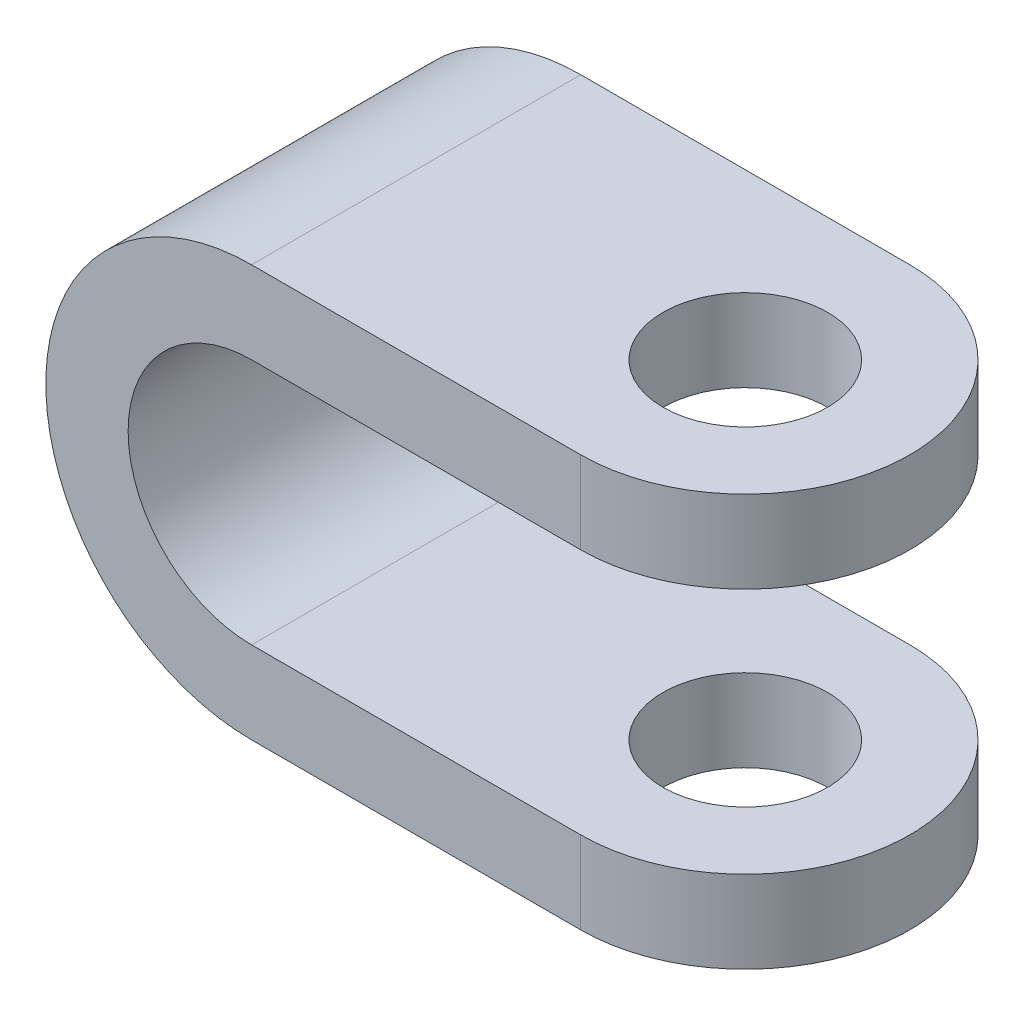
from build123d import *

# Parameters (mm, degrees)
EXTRUDE_THIN1_DEPTH = 90
SKETCH2_R           = 10
EXTRUDE1_DEPTH      = 90


with BuildPart() as part:
    # Sketch1 → Extrude-Thin1 (new body)
    with BuildSketch(Plane.XY):
        with BuildLine():
            Line((0, -15), (-60, -15))
            ThreePointArc((-60, -15), (-85, -40), (-60, -65))
            Line((-60, -65), (0, -65))
            Line((0, -65), (0, -55))
            Line((0, -55), (-60, -55))
            ThreePointArc((-60, -55), (-75, -40), (-60, -25))
            Line((-60, -25), (0, -25))
            Line((0, -25), (0, -15))
        make_face()
    extrude(amount=EXTRUDE_THIN1_DEPTH)


with BuildPart() as body_2:
    # Sketch2 → Extrude1 (new body)
    with BuildSketch(Plane(origin=(0, 0, 0), x_dir=(1, 0, 0), z_dir=(0, 1, 0))):
        with BuildLine():
            Line((-85, -25), (-85, -65))
            Line((-85, -65), (-20, -65))
            ThreePointArc((-20, -65), (0, -45), (-20, -25))
            Line((-20, -25), (-85, -25))
        make_face()
        with Locations(Location((-20, -45, 0), (0, 0, 270))):
            Circle(SKETCH2_R, mode=Mode.SUBTRACT)
    extrude(amount=-EXTRUDE1_DEPTH)

    # Combine1: intersect part
    add(part.part, mode=Mode.INTERSECT)


solid = body_2.part
